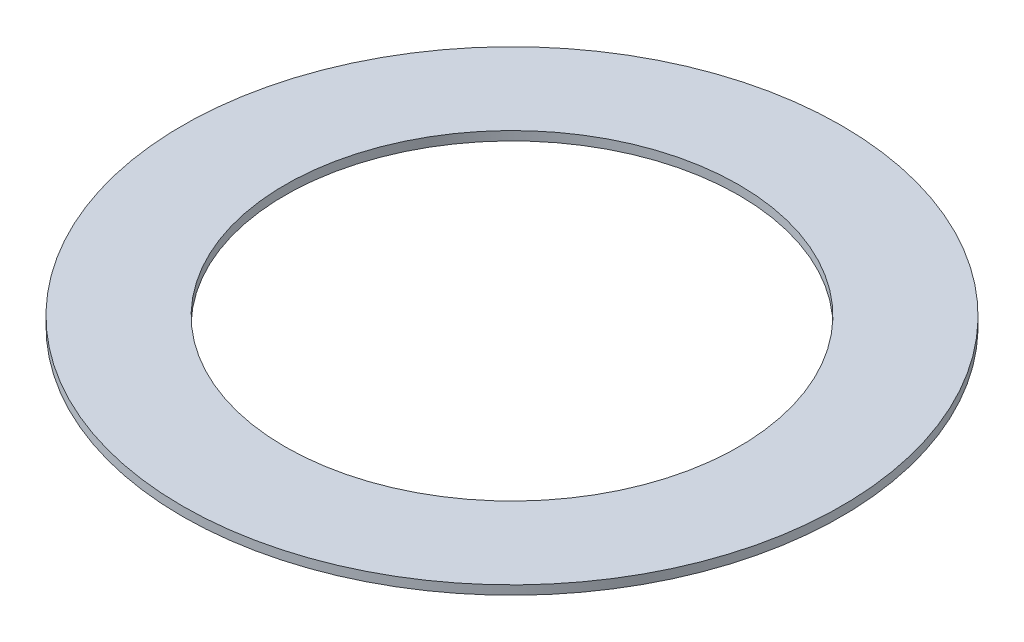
ISO-10303-21;
HEADER;
FILE_DESCRIPTION(('STEP AP214'),'2;1');
FILE_NAME('part.step','',(''),(''),'','','');
FILE_SCHEMA(('AUTOMOTIVE_DESIGN { 1 0 10303 214 1 1 1 1 }'));
ENDSEC;
DATA;
#1=APPLICATION_CONTEXT('core data for automotive mechanical design processes');
#2=APPLICATION_PROTOCOL_DEFINITION('international standard','automotive_design',2000,#1);
#3=PRODUCT_CONTEXT('',#1,'mechanical');
#4=PRODUCT('Part','Part','',(#3));
#5=PRODUCT_RELATED_PRODUCT_CATEGORY('part','',(#4));
#6=PRODUCT_DEFINITION_FORMATION('','',#4);
#7=PRODUCT_DEFINITION_CONTEXT('part definition',#1,'design');
#8=PRODUCT_DEFINITION('design','',#6,#7);
#9=PRODUCT_DEFINITION_SHAPE('','',#8);
#10=(LENGTH_UNIT() NAMED_UNIT(*) SI_UNIT(.MILLI.,.METRE.));
#11=(NAMED_UNIT(*) PLANE_ANGLE_UNIT() SI_UNIT($,.RADIAN.));
#12=(NAMED_UNIT(*) SI_UNIT($,.STERADIAN.) SOLID_ANGLE_UNIT());
#13=UNCERTAINTY_MEASURE_WITH_UNIT(LENGTH_MEASURE(1.E-05),#10,'distance_accuracy_value','');
#14=(GEOMETRIC_REPRESENTATION_CONTEXT(3) GLOBAL_UNCERTAINTY_ASSIGNED_CONTEXT((#13)) GLOBAL_UNIT_ASSIGNED_CONTEXT((#10,
#11,#12)) REPRESENTATION_CONTEXT('',''));
#15=CARTESIAN_POINT('',(0.,0.,0.));
#16=DIRECTION('',(0.,0.,1.));
#17=DIRECTION('',(1.,0.,0.));
#18=AXIS2_PLACEMENT_3D('',#15,#16,#17);
#19=CARTESIAN_POINT('',(0.,0.127,0.));
#20=DIRECTION('',(0.,1.,0.));
#21=DIRECTION('',(0.,0.,1.));
#22=AXIS2_PLACEMENT_3D('',#19,#20,#21);
#23=PLANE('',#22);
#24=CARTESIAN_POINT('',(0.,0.127,0.));
#25=DIRECTION('',(0.,1.,0.));
#26=DIRECTION('',(0.,0.,1.));
#27=AXIS2_PLACEMENT_3D('',#24,#25,#26);
#28=CIRCLE('',#27,4.6482);
#29=CARTESIAN_POINT('',(0.,0.127,4.6482));
#30=VERTEX_POINT('',#29);
#31=EDGE_CURVE('E10',#30,#30,#28,.T.);
#32=ORIENTED_EDGE('',*,*,#31,.T.);
#33=EDGE_LOOP('',(#32));
#34=FACE_BOUND('',#33,.T.);
#35=CARTESIAN_POINT('',(0.,0.127,0.));
#36=DIRECTION('',(0.,1.,0.));
#37=DIRECTION('',(0.,0.,1.));
#38=AXIS2_PLACEMENT_3D('',#35,#36,#37);
#39=CIRCLE('',#38,3.2004);
#40=CARTESIAN_POINT('',(0.,0.127,3.2004));
#41=VERTEX_POINT('',#40);
#42=EDGE_CURVE('E41',#41,#41,#39,.T.);
#43=ORIENTED_EDGE('',*,*,#42,.F.);
#44=EDGE_LOOP('',(#43));
#45=FACE_BOUND('',#44,.T.);
#46=ADVANCED_FACE('F30',(#34,#45),#23,.T.);
#47=CARTESIAN_POINT('',(0.,0.,0.));
#48=DIRECTION('',(0.,1.,0.));
#49=DIRECTION('',(0.,0.,1.));
#50=AXIS2_PLACEMENT_3D('',#47,#48,#49);
#51=PLANE('',#50);
#52=CARTESIAN_POINT('',(0.,0.,0.));
#53=DIRECTION('',(0.,1.,0.));
#54=DIRECTION('',(0.,0.,1.));
#55=AXIS2_PLACEMENT_3D('',#52,#53,#54);
#56=CIRCLE('',#55,4.6482);
#57=CARTESIAN_POINT('',(0.,0.,4.6482));
#58=VERTEX_POINT('',#57);
#59=EDGE_CURVE('E34',#58,#58,#56,.T.);
#60=ORIENTED_EDGE('',*,*,#59,.F.);
#61=EDGE_LOOP('',(#60));
#62=FACE_BOUND('',#61,.T.);
#63=CARTESIAN_POINT('',(0.,0.,0.));
#64=DIRECTION('',(0.,1.,0.));
#65=DIRECTION('',(0.,0.,1.));
#66=AXIS2_PLACEMENT_3D('',#63,#64,#65);
#67=CIRCLE('',#66,3.2004);
#68=CARTESIAN_POINT('',(0.,0.,3.2004));
#69=VERTEX_POINT('',#68);
#70=EDGE_CURVE('E43',#69,#69,#67,.T.);
#71=ORIENTED_EDGE('',*,*,#70,.T.);
#72=EDGE_LOOP('',(#71));
#73=FACE_BOUND('',#72,.T.);
#74=ADVANCED_FACE('F53',(#62,#73),#51,.F.);
#75=CARTESIAN_POINT('',(0.,0.127,0.));
#76=DIRECTION('',(0.,-1.,0.));
#77=DIRECTION('',(0.,0.,-1.));
#78=AXIS2_PLACEMENT_3D('',#75,#76,#77);
#79=CYLINDRICAL_SURFACE('',#78,4.6482);
#80=ORIENTED_EDGE('',*,*,#31,.F.);
#81=EDGE_LOOP('',(#80));
#82=FACE_BOUND('',#81,.T.);
#83=ORIENTED_EDGE('',*,*,#59,.T.);
#84=EDGE_LOOP('',(#83));
#85=FACE_BOUND('',#84,.T.);
#86=ADVANCED_FACE('F32',(#82,#85),#79,.T.);
#87=CARTESIAN_POINT('',(0.,0.127,0.));
#88=DIRECTION('',(0.,-1.,0.));
#89=DIRECTION('',(0.,0.,-1.));
#90=AXIS2_PLACEMENT_3D('',#87,#88,#89);
#91=CYLINDRICAL_SURFACE('',#90,3.2004);
#92=ORIENTED_EDGE('',*,*,#42,.T.);
#93=EDGE_LOOP('',(#92));
#94=FACE_BOUND('',#93,.T.);
#95=ORIENTED_EDGE('',*,*,#70,.F.);
#96=EDGE_LOOP('',(#95));
#97=FACE_BOUND('',#96,.T.);
#98=ADVANCED_FACE('F49',(#94,#97),#91,.F.);
#99=CLOSED_SHELL('',(#46,#74,#86,#98));
#100=MANIFOLD_SOLID_BREP('B2',#99);
#101=ADVANCED_BREP_SHAPE_REPRESENTATION('',(#18,#100),#14);
#102=SHAPE_DEFINITION_REPRESENTATION(#9,#101);
ENDSEC;
END-ISO-10303-21;
